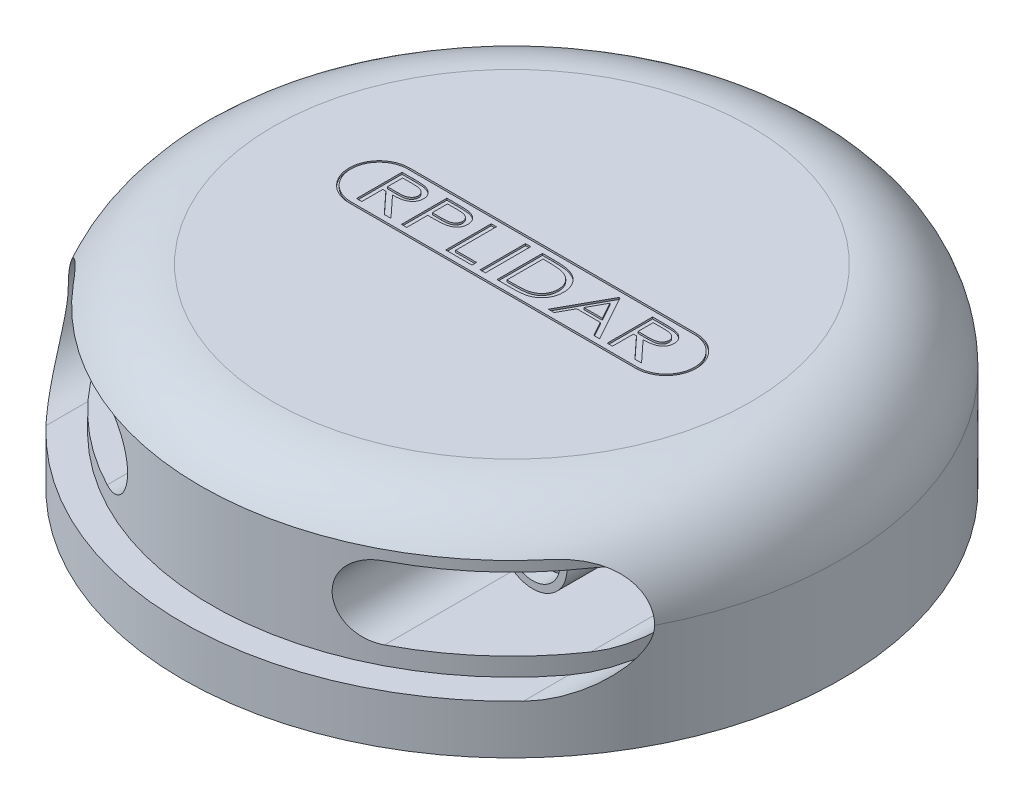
from build123d import *

# Parameters (mm, degrees)
IZIM1_R                     = 36.25
Y_KSEKLIK_EKSTR_ZYON1_DEPTH = 21.4
RADYUS1_R                   = 10
KES_EKSTR_ZYON1_DEPTH       = 41.4
IZIM3_R                     = 33.003248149
Y_KSEKLIK_EKSTR_ZYON2_DEPTH = 12.4
KES_EKSTR_ZYON2_DEPTH       = 44.4
IZIM5_R                     = 3.775
IZIM5_R_2                   = 3
IZIM5_R_3                   = 1.5
Y_KSEKLIK_EKSTR_ZYON4_DEPTH = 16
IZIM6_R                     = 35
KES_EKSTR_ZYON3_DEPTH       = 5
Y_KSEKLIK_EKSTR_ZYON5_START = -3
IZIM8_R                     = 1.5
IZIM8_R_2                   = 3
Y_KSEKLIK_EKSTR_ZYON5_DEPTH = 1
IZIM9_W                     = 0.576923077
IZIM9_H                     = 5
KES_EKSTR_ZYON4_DEPTH       = 0.2
KES_EKSTR_ZYON5_DEPTH       = 0.2


with BuildPart() as part:
    # izim1 → Y_kseklik-Ekstr_zyon1 (new body)
    with BuildSketch(Plane(origin=(0, 0, 0), x_dir=(1, 0, 0), z_dir=(0, 1, 0))):
        with Locations(Location((0, 0, 0), (0, 0, 270))):
            Circle(IZIM1_R)
    extrude(amount=Y_KSEKLIK_EKSTR_ZYON1_DEPTH)

    # Radyus1
    radyus1_edges = [part.edges().sort_by_distance(p)[0] for p in [
        (0, 21.4, -36.25),
    ]]
    fillet(radyus1_edges, radius=RADYUS1_R)

    # izim2 → Kes-Ekstr_zyon1 (cut)
    with BuildSketch(Plane.XY):
        with BuildLine():
            Line((-26.25, 17.4), (26.25, 17.4))
            ThreePointArc((26.25, 17.4), (32.25, 11.4), (26.25, 5.4))
            Line((26.25, 5.4), (-26.25, 5.4))
            ThreePointArc((-26.25, 5.4), (-32.25, 11.4), (-26.25, 17.4))
        make_face()
    extrude(amount=KES_EKSTR_ZYON1_DEPTH, mode=Mode.SUBTRACT)

    # izim3 → Y_kseklik-Ekstr_zyon2 (add)
    with BuildSketch(Plane(origin=(0, 5.4, 0), x_dir=(1, 0, 0), z_dir=(0, 1, 0))):
        Circle(IZIM3_R)
    extrude(amount=Y_KSEKLIK_EKSTR_ZYON2_DEPTH)

    # izim4 → Kes-Ekstr_zyon2 (cut)
    with BuildSketch(Plane.XY):
        with BuildLine():
            Line((-27.25, 15.4), (-15.25, 15.4))
            ThreePointArc((-15.25, 15.4), (-11.25, 11.4), (-15.25, 7.4))
            Line((-15.25, 7.4), (-27.25, 7.4))
            ThreePointArc((-27.25, 7.4), (-31.25, 11.4), (-27.25, 15.4))
        make_face()
        with BuildLine():
            Line((27.25, 15.4), (15.25, 15.4))
            ThreePointArc((15.25, 15.4), (11.25, 11.4), (15.25, 7.4))
            Line((15.25, 7.4), (27.25, 7.4))
            ThreePointArc((27.25, 7.4), (31.25, 11.4), (27.25, 15.4))
        make_face()
    extrude(amount=KES_EKSTR_ZYON2_DEPTH, mode=Mode.SUBTRACT)

    # izim5 → Y_kseklik-Ekstr_zyon4 (add)
    # profile 1 of 2: a face of its own
    with BuildSketch(Plane.XY):
        with Locations(Location((18.281419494, 11.4, 0), (0, 0, 180))):
            Circle(IZIM5_R)
        with Locations((18.281419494, 11.4)):
            Circle(IZIM5_R_2, mode=Mode.SUBTRACT)
    # profile 2 of 2: a face of its own
    with BuildSketch(Plane.XY):
        with Locations((-26.25, 11.4)):
            Circle(IZIM5_R_2)
        with Locations((-26.25, 11.4)):
            Circle(IZIM5_R_3, mode=Mode.SUBTRACT)
    extrude(amount=Y_KSEKLIK_EKSTR_ZYON4_DEPTH)

    # izim6 → Kes-Ekstr_zyon3 (cut)
    with BuildSketch(Plane.XZ):
        with Locations(Location((0, 0, 0), (0, 0, 270))):
            Circle(IZIM6_R)
    extrude(amount=-KES_EKSTR_ZYON3_DEPTH, mode=Mode.SUBTRACT)

    # izim8 → Y_kseklik-Ekstr_zyon5 (add)
    with BuildSketch(Plane.XY.offset(16).offset(Y_KSEKLIK_EKSTR_ZYON5_START)):
        with Locations((-26.25, 11.4)):
            Circle(IZIM8_R)
        with Locations((18.281419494, 11.4)):
            Circle(IZIM8_R_2)
    extrude(amount=Y_KSEKLIK_EKSTR_ZYON5_DEPTH)

    # izim9 → Kes-Ekstr_zyon4 (cut)
    # profile 1 of 7: a face of its own
    with BuildSketch(Plane(origin=(0, 21.4, 0), x_dir=(1, 0, 0), z_dir=(0, 1, 0))):
        with BuildLine():
            Line((-14.811265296, 2.721015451), (-13.627371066, 2.721015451))
            add(Edge.make_bspline(
                [(-13.627371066, 2.721015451), (-13.548244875, 2.720793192), (-13.396329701, 2.720366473), (-13.178606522, 2.717986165), (-12.98065628, 2.71115411), (-12.802931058, 2.705348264), (-12.645070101, 2.694505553), (-12.507339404, 2.684541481), (-12.389357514, 2.670789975), (-12.317901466, 2.658518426), (-12.28522363, 2.652906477)],
                knots=[0, 0, 0, 0, 1.411630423, 2.710203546, 3.884117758, 4.945139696, 5.88215703, 6.706718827, 7.408564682, 8, 8, 8, 8], degree=3))
            add(Edge.make_bspline(
                [(-12.28522363, 2.652906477), (-12.241996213, 2.643872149), (-12.156775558, 2.626061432), (-12.033721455, 2.58862483), (-11.916749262, 2.544151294), (-11.805359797, 2.493741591), (-11.700921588, 2.434021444), (-11.602452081, 2.367805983), (-11.509613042, 2.29454005), (-11.424454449, 2.213570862), (-11.345348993, 2.128176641), (-11.278753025, 2.035341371), (-11.220672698, 1.938996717), (-11.174658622, 1.836946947), (-11.138537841, 1.730578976), (-11.112429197, 1.61925413), (-11.095858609, 1.503233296), (-11.09417105, 1.423996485), (-11.093316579, 1.383876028)],
                knots=[0, 0, 0, 0, 1.11641643, 2.200958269, 3.248516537, 4.279957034, 5.289565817, 6.287204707, 7.27885839, 8.276390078, 9.256727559, 10.217710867, 11.160418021, 12.097511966, 13.042749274, 13.99714418, 14.985881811, 16, 16, 16, 16], degree=3))
            add(Edge.make_bspline(
                [(-11.093316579, 1.383876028), (-11.094253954, 1.350137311), (-11.096104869, 1.283517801), (-11.105764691, 1.184938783), (-11.124030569, 1.089893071), (-11.149031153, 0.997619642), (-11.182319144, 0.909146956), (-11.221524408, 0.822778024), (-11.268558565, 0.740078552), (-11.322707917, 0.660565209), (-11.384212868, 0.585994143), (-11.450083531, 0.513978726), (-11.523642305, 0.448211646), (-11.603000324, 0.386459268), (-11.689506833, 0.331172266), (-11.780867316, 0.27819848), (-11.879220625, 0.231612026), (-11.984085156, 0.189009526), (-12.097345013, 0.15219902), (-12.219458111, 0.118639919), (-12.352204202, 0.09256061), (-12.494755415, 0.069109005), (-12.647858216, 0.051490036), (-12.811222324, 0.038627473), (-12.984595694, 0.030532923), (-13.103523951, 0.029327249), (-13.164630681, 0.028707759)],
                knots=[0, 0, 0, 0, 0.870437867, 1.718741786, 2.551384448, 3.36406043, 4.181467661, 4.986810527, 5.808199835, 6.632248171, 7.464757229, 8.299534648, 9.147007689, 10.006514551, 10.890268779, 11.792828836, 12.72878645, 13.694651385, 14.710400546, 15.798752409, 16.958998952, 18.197760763, 19.524398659, 20.932521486, 22.423893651, 24, 24, 24, 24], degree=3))
            Line((-13.164630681, 0.028707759), (-11.029214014, -2.278984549))
            Line((-11.029214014, -2.278984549), (-11.760383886, -2.278984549))
            Line((-11.760383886, -2.278984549), (-13.895800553, 0.028707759))
            Line((-13.895800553, 0.028707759), (-14.23434222, 0.028707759))
            Line((-14.23434222, 0.028707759), (-14.23434222, -2.278984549))
            Line((-14.23434222, -2.278984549), (-14.811265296, -2.278984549))
            Line((-14.811265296, -2.278984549), (-14.811265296, 2.721015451))
        make_face()
        with BuildLine():
            Line((-14.23434222, 2.208194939), (-14.23434222, 0.541528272))
            Line((-14.23434222, 0.541528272), (-13.18766754, 0.534517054))
            add(Edge.make_bspline(
                [(-13.18766754, 0.534517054), (-13.138582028, 0.534493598), (-13.043720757, 0.534448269), (-12.906502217, 0.540178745), (-12.779219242, 0.546624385), (-12.661954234, 0.55656408), (-12.554368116, 0.569522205), (-12.456697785, 0.585113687), (-12.368746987, 0.604171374), (-12.266340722, 0.632784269), (-12.151725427, 0.677602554), (-12.028064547, 0.745040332), (-11.921230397, 0.827527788), (-11.83125886, 0.923244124), (-11.760411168, 1.029154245), (-11.708128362, 1.142178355), (-11.675668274, 1.261552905), (-11.672056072, 1.343613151), (-11.670239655, 1.384877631)],
                knots=[0, 0, 0, 0, 1.205111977, 2.328965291, 3.371672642, 4.334318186, 5.217938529, 6.031964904, 6.761988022, 7.426368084, 8.641199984, 9.775054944, 10.873689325, 11.940859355, 12.986752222, 13.988165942, 14.988337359, 16, 16, 16, 16], degree=3))
            add(Edge.make_bspline(
                [(-11.670239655, 1.384877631), (-11.672061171, 1.425144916), (-11.675684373, 1.505241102), (-11.708222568, 1.622094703), (-11.761218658, 1.732611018), (-11.834010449, 1.835456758), (-11.922208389, 1.92921002), (-12.025971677, 2.009043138), (-12.142215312, 2.074614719), (-12.250002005, 2.116675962), (-12.346166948, 2.142423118), (-12.429966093, 2.160738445), (-12.524988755, 2.175339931), (-12.631304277, 2.186907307), (-12.748494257, 2.197137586), (-12.877102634, 2.2038767), (-13.016700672, 2.207891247), (-13.113545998, 2.20809142), (-13.163629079, 2.208194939)],
                knots=[0, 0, 0, 0, 1.007089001, 2.003213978, 3.013250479, 4.064283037, 5.146917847, 6.225928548, 7.33072321, 8.480016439, 9.113044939, 9.823344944, 10.627712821, 11.519897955, 12.501985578, 13.574102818, 14.745459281, 16, 16, 16, 16], degree=3))
            Line((-13.163629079, 2.208194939), (-14.23434222, 2.208194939))
        make_face(mode=Mode.SUBTRACT)
    # profile 2 of 7: a face of its own
    with BuildSketch(Plane(origin=(0, 21.4, 0), x_dir=(1, 0, 0), z_dir=(0, 1, 0))):
        with BuildLine():
            Line((-9.875367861, 2.721015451), (-8.710504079, 2.721015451))
            add(Edge.make_bspline(
                [(-8.710504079, 2.721015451), (-8.630373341, 2.720944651), (-8.477111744, 2.720809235), (-8.257084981, 2.71646929), (-8.057404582, 2.710767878), (-7.878103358, 2.702738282), (-7.719387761, 2.693416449), (-7.58118934, 2.680043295), (-7.462638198, 2.666340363), (-7.390996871, 2.652296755), (-7.358340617, 2.645895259)],
                knots=[0, 0, 0, 0, 1.418218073, 2.712546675, 3.894916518, 4.953717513, 5.889237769, 6.708316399, 7.411212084, 8, 8, 8, 8], degree=3))
            add(Edge.make_bspline(
                [(-7.358340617, 2.645895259), (-7.317467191, 2.63642007), (-7.236671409, 2.617690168), (-7.119783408, 2.580660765), (-7.008739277, 2.536245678), (-6.903326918, 2.485000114), (-6.803104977, 2.427412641), (-6.709446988, 2.361436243), (-6.621028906, 2.289515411), (-6.539189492, 2.210256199), (-6.463834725, 2.126181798), (-6.399267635, 2.034792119), (-6.344417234, 1.938827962), (-6.298035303, 1.837655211), (-6.265146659, 1.730271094), (-6.239461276, 1.618239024), (-6.224319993, 1.500809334), (-6.222465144, 1.420644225), (-6.221521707, 1.379869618)],
                knots=[0, 0, 0, 0, 1.086341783, 2.147405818, 3.171829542, 4.181180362, 5.180780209, 6.161883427, 7.145042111, 8.129606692, 9.109794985, 10.064714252, 11.021393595, 11.969594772, 12.940393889, 13.924236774, 14.944198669, 16, 16, 16, 16], degree=3))
            add(Edge.make_bspline(
                [(-6.221521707, 1.379869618), (-6.222555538, 1.33877025), (-6.224578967, 1.258329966), (-6.23834793, 1.140147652), (-6.263672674, 1.027954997), (-6.298011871, 0.921112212), (-6.340494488, 0.819051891), (-6.395686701, 0.723873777), (-6.45849134, 0.632979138), (-6.532189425, 0.549188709), (-6.613551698, 0.470727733), (-6.702713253, 0.398693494), (-6.799247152, 0.333432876), (-6.902784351, 0.275200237), (-7.013805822, 0.224088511), (-7.131866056, 0.179073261), (-7.25777106, 0.14082902), (-7.34485006, 0.1209878), (-7.389390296, 0.110839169)],
                knots=[0, 0, 0, 0, 1.045861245, 2.046974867, 3.021934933, 3.967695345, 4.900313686, 5.828704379, 6.76205769, 7.707550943, 8.662917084, 9.635505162, 10.620482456, 11.624763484, 12.654874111, 13.727818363, 14.837796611, 16, 16, 16, 16], degree=3))
            add(Edge.make_bspline(
                [(-7.389390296, 0.110839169), (-7.426065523, 0.104178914), (-7.506467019, 0.089577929), (-7.638854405, 0.073203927), (-7.792859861, 0.059439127), (-7.968572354, 0.048892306), (-8.165578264, 0.040022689), (-8.384271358, 0.03291367), (-8.624685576, 0.029015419), (-8.792300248, 0.028813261), (-8.879774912, 0.028707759)],
                knots=[0, 0, 0, 0, 0.59852503, 1.312120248, 2.141233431, 3.081389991, 4.138754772, 5.308216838, 6.595213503, 8, 8, 8, 8], degree=3))
            Line((-8.879774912, 0.028707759), (-9.298444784, 0.028707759))
            Line((-9.298444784, 0.028707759), (-9.298444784, -2.278984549))
            Line((-9.298444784, -2.278984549), (-9.875367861, -2.278984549))
            Line((-9.875367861, -2.278984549), (-9.875367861, 2.721015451))
        make_face()
        with BuildLine():
            Line((-9.298444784, 2.208194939), (-9.298444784, 0.541528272))
            Line((-9.298444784, 0.541528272), (-8.294839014, 0.530510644))
            add(Edge.make_bspline(
                [(-8.294839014, 0.530510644), (-8.245753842, 0.530490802), (-8.150893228, 0.530452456), (-8.014003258, 0.536120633), (-7.887068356, 0.542708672), (-7.770432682, 0.552369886), (-7.663986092, 0.565852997), (-7.567729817, 0.579684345), (-7.482103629, 0.599529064), (-7.38228731, 0.626032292), (-7.271042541, 0.671364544), (-7.15018903, 0.737642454), (-7.046293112, 0.821251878), (-6.957257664, 0.916157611), (-6.887843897, 1.022478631), (-6.834970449, 1.134965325), (-6.804201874, 1.254717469), (-6.800372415, 1.336632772), (-6.798444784, 1.377866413)],
                knots=[0, 0, 0, 0, 1.216884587, 2.351716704, 3.39634486, 4.368394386, 5.252429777, 6.056753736, 6.777742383, 7.430440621, 8.615602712, 9.746078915, 10.835909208, 11.907861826, 12.959387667, 13.97058409, 14.978454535, 16, 16, 16, 16], degree=3))
            add(Edge.make_bspline(
                [(-6.798444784, 1.377866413), (-6.800384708, 1.418104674), (-6.804254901, 1.498380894), (-6.835209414, 1.616044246), (-6.887762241, 1.7273631), (-6.957665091, 1.832272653), (-7.044323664, 1.927108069), (-7.145903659, 2.007591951), (-7.259210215, 2.075112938), (-7.365266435, 2.116342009), (-7.459613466, 2.142639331), (-7.541517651, 2.160498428), (-7.633815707, 2.175332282), (-7.736467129, 2.186923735), (-7.849650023, 2.197153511), (-7.973589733, 2.203833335), (-8.10817862, 2.207912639), (-8.201352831, 2.20809841), (-8.249766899, 2.208194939)],
                knots=[0, 0, 0, 0, 1.024572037, 2.044043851, 3.075692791, 4.149430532, 5.245489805, 6.335123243, 7.441242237, 8.594652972, 9.222274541, 9.936592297, 10.729720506, 11.603583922, 12.568814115, 13.625561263, 14.766222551, 16, 16, 16, 16], degree=3))
            Line((-8.249766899, 2.208194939), (-9.298444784, 2.208194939))
        make_face(mode=Mode.SUBTRACT)
    # profile 3 of 7: a face of its own
    with BuildSketch(Plane(origin=(0, 21.4, 0), x_dir=(1, 0, 0), z_dir=(0, 1, 0))):
        Polygon((-5.003572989, 2.721015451), (-4.426649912, 2.721015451), (-4.426649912, -1.766164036), (-2.118957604, -1.766164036), (-2.118957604, -2.278984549), (-5.003572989, -2.278984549), align=None)
    # profile 4 of 7: a face of its own
    with BuildSketch(Plane(origin=(0, 21.4, 0), x_dir=(1, 0, 0), z_dir=(0, 1, 0))):
        with Locations((-0.933060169, 0.221015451)):
            Rectangle(IZIM9_W, IZIM9_H)
    # profile 5 of 7: a face of its own
    with BuildSketch(Plane(origin=(0, 21.4, 0), x_dir=(1, 0, 0), z_dir=(0, 1, 0))):
        with BuildLine():
            Line((0.637452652, -2.278984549), (0.637452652, 2.721015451))
            Line((0.637452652, 2.721015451), (1.836370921, 2.721015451))
            add(Edge.make_bspline(
                [(1.836370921, 2.721015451), (1.940876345, 2.720385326), (2.142574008, 2.71916917), (2.433791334, 2.711417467), (2.702677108, 2.697772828), (2.949134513, 2.677650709), (3.173764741, 2.653365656), (3.376299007, 2.622480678), (3.55677558, 2.586624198), (3.668125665, 2.555387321), (3.720385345, 2.54072699)],
                knots=[0, 0, 0, 0, 1.3211948, 2.549933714, 3.682670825, 4.72443222, 5.675778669, 6.538377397, 7.314020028, 8, 8, 8, 8], degree=3))
            add(Edge.make_bspline(
                [(3.720385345, 2.54072699), (3.78885106, 2.518690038), (3.923860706, 2.475234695), (4.117410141, 2.393701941), (4.299204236, 2.300062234), (4.470798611, 2.196092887), (4.629410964, 2.078397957), (4.778390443, 1.951125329), (4.913262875, 1.809885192), (5.037791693, 1.658991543), (5.148542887, 1.498054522), (5.245546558, 1.329083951), (5.326280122, 1.152059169), (5.394413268, 0.968294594), (5.444930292, 0.775878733), (5.481642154, 0.576344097), (5.505906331, 0.369514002), (5.508123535, 0.229097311), (5.509247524, 0.15791449)],
                knots=[0, 0, 0, 0, 1.07436122, 2.118565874, 3.133765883, 4.127984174, 5.11282082, 6.081965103, 7.052225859, 8.026990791, 9.002585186, 9.967895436, 10.934455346, 11.906676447, 12.892927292, 13.902719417, 14.936804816, 16, 16, 16, 16], degree=3))
            add(Edge.make_bspline(
                [(5.509247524, 0.15791449), (5.50800468, 0.096116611), (5.505554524, -0.025712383), (5.488794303, -0.205603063), (5.458167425, -0.379469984), (5.417247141, -0.547832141), (5.365414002, -0.711283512), (5.299748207, -0.868246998), (5.223846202, -1.020327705), (5.135243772, -1.164883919), (5.03887547, -1.302648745), (4.933836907, -1.431592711), (4.822507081, -1.551539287), (4.702978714, -1.66121317), (4.578158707, -1.762801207), (4.445079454, -1.854367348), (4.304818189, -1.936036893), (4.157101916, -2.010455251), (3.998149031, -2.07508686), (3.825271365, -2.129897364), (3.637389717, -2.17546385), (3.434426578, -2.213334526), (3.21650904, -2.243263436), (2.983182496, -2.263630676), (2.735302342, -2.277131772), (2.564888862, -2.27835601), (2.477396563, -2.278984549)],
                knots=[0, 0, 0, 0, 1.007638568, 1.986469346, 2.942307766, 3.883713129, 4.809932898, 5.734968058, 6.655233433, 7.578585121, 8.496851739, 9.394671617, 10.288256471, 11.162750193, 12.037599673, 12.910397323, 13.793641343, 14.68225427, 15.605220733, 16.588265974, 17.636610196, 18.755552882, 19.95349296, 21.221625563, 22.573549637, 24, 24, 24, 24], degree=3))
            Line((2.477396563, -2.278984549), (0.637452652, -2.278984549))
        make_face()
        with BuildLine():
            Line((1.214375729, -1.766164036), (1.880441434, -1.766164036))
            add(Edge.make_bspline(
                [(1.880441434, -1.766164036), (1.976264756, -1.76581211), (2.160252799, -1.765136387), (2.424719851, -1.759143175), (2.666163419, -1.74937351), (2.88493929, -1.735682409), (3.080638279, -1.717678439), (3.253852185, -1.697337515), (3.40418184, -1.672322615), (3.495804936, -1.649496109), (3.538093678, -1.63896051)],
                knots=[0, 0, 0, 0, 1.380201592, 2.650091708, 3.810045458, 4.860555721, 5.807075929, 6.640357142, 7.372455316, 8, 8, 8, 8], degree=3))
            add(Edge.make_bspline(
                [(3.538093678, -1.63896051), (3.591068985, -1.622949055), (3.695155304, -1.591489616), (3.845436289, -1.533211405), (3.986347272, -1.464839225), (4.119648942, -1.388963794), (4.24309805, -1.302459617), (4.35738543, -1.206669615), (4.464582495, -1.103492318), (4.561401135, -0.990171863), (4.648381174, -0.869138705), (4.724912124, -0.741725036), (4.789533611, -0.607702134), (4.841418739, -0.466661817), (4.88267694, -0.319349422), (4.911527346, -0.165528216), (4.928781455, -0.005408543), (4.931128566, 0.103450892), (4.932324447, 0.158916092)],
                knots=[0, 0, 0, 0, 1.078749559, 2.11953602, 3.138517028, 4.12999422, 5.106941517, 6.072897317, 7.034985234, 8.004378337, 8.974470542, 9.9378788, 10.898644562, 11.870787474, 12.864185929, 13.877851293, 14.918739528, 16, 16, 16, 16], degree=3))
            add(Edge.make_bspline(
                [(4.932324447, 0.158916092), (4.93128137, 0.217395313), (4.929231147, 0.332339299), (4.909767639, 0.501207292), (4.877615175, 0.663261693), (4.833326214, 0.818975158), (4.777845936, 0.969098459), (4.706678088, 1.111588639), (4.624641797, 1.248160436), (4.530358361, 1.377760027), (4.42424139, 1.498215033), (4.308720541, 1.610672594), (4.181675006, 1.711203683), (4.046589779, 1.804372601), (3.900062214, 1.885051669), (3.744855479, 1.95772211), (3.578720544, 2.018752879), (3.463539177, 2.051363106), (3.404880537, 2.06797058)],
                knots=[0, 0, 0, 0, 1.058669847, 2.080871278, 3.073316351, 4.047471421, 5.009847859, 5.967025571, 6.92717743, 7.89220902, 8.864786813, 9.831124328, 10.807453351, 11.795172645, 12.799353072, 13.832651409, 14.896230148, 16, 16, 16, 16], degree=3))
            add(Edge.make_bspline(
                [(3.404880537, 2.06797058), (3.356258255, 2.079589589), (3.252310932, 2.104429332), (3.083799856, 2.13090293), (2.893764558, 2.155039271), (2.681981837, 2.174829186), (2.447814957, 2.189382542), (2.192018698, 2.200109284), (1.914204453, 2.207445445), (1.721859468, 2.20793885), (1.622027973, 2.208194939)],
                knots=[0, 0, 0, 0, 0.669246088, 1.430750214, 2.28257198, 3.234651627, 4.278572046, 5.424227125, 6.663114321, 8, 8, 8, 8], degree=3))
            Line((1.622027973, 2.208194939), (1.214375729, 2.208194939))
            Line((1.214375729, 2.208194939), (1.214375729, -1.766164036))
        make_face(mode=Mode.SUBTRACT)
    # profile 6 of 7: a face of its own
    with BuildSketch(Plane(origin=(0, 21.4, 0), x_dir=(1, 0, 0), z_dir=(0, 1, 0))):
        Polygon((9.163093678, 2.721015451), (11.919503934, -2.278984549), (11.283486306, -2.278984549), (10.400072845, -0.676420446), (7.798910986, -0.676420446), (6.914495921, -2.278984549), (6.278478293, -2.278984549), (9.03488855, 2.721015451), align=None)
        Polygon((9.098991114, 1.682353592), (8.080361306, -0.163599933), (10.116619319, -0.163599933), align=None, mode=Mode.SUBTRACT)
    # profile 7 of 7: a face of its own
    with BuildSketch(Plane(origin=(0, 21.4, 0), x_dir=(1, 0, 0), z_dir=(0, 1, 0))):
        with BuildLine():
            Line((12.752837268, 2.721015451), (13.936731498, 2.721015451))
            add(Edge.make_bspline(
                [(13.936731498, 2.721015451), (14.015857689, 2.720793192), (14.167772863, 2.720366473), (14.385496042, 2.717986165), (14.583446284, 2.71115411), (14.761171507, 2.705348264), (14.919032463, 2.694505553), (15.05676316, 2.684541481), (15.17474505, 2.670789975), (15.246201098, 2.658518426), (15.278878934, 2.652906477)],
                knots=[0, 0, 0, 0, 1.411630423, 2.710203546, 3.884117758, 4.945139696, 5.88215703, 6.706718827, 7.408564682, 8, 8, 8, 8], degree=3))
            add(Edge.make_bspline(
                [(15.278878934, 2.652906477), (15.322106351, 2.643872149), (15.407327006, 2.626061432), (15.530381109, 2.58862483), (15.647353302, 2.544151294), (15.758742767, 2.493741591), (15.863180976, 2.434021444), (15.961650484, 2.367805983), (16.054489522, 2.29454005), (16.139648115, 2.213570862), (16.218753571, 2.128176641), (16.285349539, 2.035341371), (16.343429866, 1.938996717), (16.389443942, 1.836946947), (16.425564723, 1.730578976), (16.451673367, 1.61925413), (16.468243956, 1.503233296), (16.469931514, 1.423996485), (16.470785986, 1.383876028)],
                knots=[0, 0, 0, 0, 1.11641643, 2.200958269, 3.248516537, 4.279957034, 5.289565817, 6.287204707, 7.27885839, 8.276390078, 9.256727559, 10.217710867, 11.160418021, 12.097511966, 13.042749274, 13.99714418, 14.985881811, 16, 16, 16, 16], degree=3))
            add(Edge.make_bspline(
                [(16.470785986, 1.383876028), (16.46984861, 1.350137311), (16.467997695, 1.283517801), (16.458337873, 1.184938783), (16.440071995, 1.089893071), (16.415071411, 0.997619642), (16.38178342, 0.909146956), (16.342578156, 0.822778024), (16.295543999, 0.740078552), (16.241394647, 0.660565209), (16.179889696, 0.585994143), (16.114019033, 0.513978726), (16.040460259, 0.448211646), (15.96110224, 0.386459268), (15.874595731, 0.331172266), (15.783235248, 0.27819848), (15.684881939, 0.231612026), (15.580017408, 0.189009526), (15.466757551, 0.15219902), (15.344644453, 0.118639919), (15.211898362, 0.09256061), (15.069347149, 0.069109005), (14.916244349, 0.051490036), (14.75288024, 0.038627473), (14.57950687, 0.030532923), (14.460578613, 0.029327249), (14.399471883, 0.028707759)],
                knots=[0, 0, 0, 0, 0.870437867, 1.718741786, 2.551384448, 3.36406043, 4.181467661, 4.986810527, 5.808199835, 6.632248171, 7.464757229, 8.299534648, 9.147007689, 10.006514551, 10.890268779, 11.792828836, 12.72878645, 13.694651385, 14.710400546, 15.798752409, 16.958998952, 18.197760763, 19.524398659, 20.932521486, 22.423893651, 24, 24, 24, 24], degree=3))
            Line((14.399471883, 0.028707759), (16.53488855, -2.278984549))
            Line((16.53488855, -2.278984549), (15.803718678, -2.278984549))
            Line((15.803718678, -2.278984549), (13.668302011, 0.028707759))
            Line((13.668302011, 0.028707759), (13.329760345, 0.028707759))
            Line((13.329760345, 0.028707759), (13.329760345, -2.278984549))
            Line((13.329760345, -2.278984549), (12.752837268, -2.278984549))
            Line((12.752837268, -2.278984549), (12.752837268, 2.721015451))
        make_face()
        with BuildLine():
            Line((13.329760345, 2.208194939), (13.329760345, 0.541528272))
            Line((13.329760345, 0.541528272), (14.376435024, 0.534517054))
            add(Edge.make_bspline(
                [(14.376435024, 0.534517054), (14.425520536, 0.534493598), (14.520381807, 0.534448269), (14.657600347, 0.540178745), (14.784883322, 0.546624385), (14.90214833, 0.55656408), (15.009734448, 0.569522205), (15.107404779, 0.585113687), (15.195355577, 0.604171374), (15.297761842, 0.632784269), (15.412377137, 0.677602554), (15.536038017, 0.745040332), (15.642872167, 0.827527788), (15.732843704, 0.923244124), (15.803691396, 1.029154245), (15.855974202, 1.142178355), (15.888434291, 1.261552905), (15.892046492, 1.343613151), (15.893862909, 1.384877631)],
                knots=[0, 0, 0, 0, 1.205111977, 2.328965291, 3.371672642, 4.334318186, 5.217938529, 6.031964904, 6.761988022, 7.426368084, 8.641199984, 9.775054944, 10.873689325, 11.940859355, 12.986752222, 13.988165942, 14.988337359, 16, 16, 16, 16], degree=3))
            add(Edge.make_bspline(
                [(15.893862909, 1.384877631), (15.892041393, 1.425144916), (15.888418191, 1.505241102), (15.855879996, 1.622094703), (15.802883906, 1.732611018), (15.730092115, 1.835456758), (15.641894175, 1.92921002), (15.538130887, 2.009043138), (15.421887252, 2.074614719), (15.314100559, 2.116675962), (15.217935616, 2.142423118), (15.134136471, 2.160738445), (15.03911381, 2.175339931), (14.932798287, 2.186907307), (14.815608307, 2.197137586), (14.68699993, 2.2038767), (14.547401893, 2.207891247), (14.450556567, 2.20809142), (14.400473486, 2.208194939)],
                knots=[0, 0, 0, 0, 1.007089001, 2.003213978, 3.013250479, 4.064283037, 5.146917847, 6.225928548, 7.33072321, 8.480016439, 9.113044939, 9.823344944, 10.627712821, 11.519897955, 12.501985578, 13.574102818, 14.745459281, 16, 16, 16, 16], degree=3))
            Line((14.400473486, 2.208194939), (13.329760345, 2.208194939))
        make_face(mode=Mode.SUBTRACT)
    extrude(amount=-KES_EKSTR_ZYON4_DEPTH, mode=Mode.SUBTRACT)

    # izim10 → Kes-Ekstr_zyon5 (cut)
    with BuildSketch(Plane(origin=(0, 21.4, 0), x_dir=(1, 0, 0), z_dir=(0, 1, 0))):
        with BuildLine():
            Line((-14.811265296, 3.545310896), (16.728928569, 3.545310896))
            ThreePointArc((16.728928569, 3.545310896), (20.053224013, 0.221015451), (16.728928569, -3.103279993))
            Line((16.728928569, -3.103279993), (-14.811265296, -3.103279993))
            ThreePointArc((-14.811265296, -3.103279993), (-18.135560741, 0.221015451), (-14.811265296, 3.545310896))
        make_face()
        with BuildLine():
            Line((-14.811265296, 3.345310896), (16.728928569, 3.345310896))
            ThreePointArc((16.728928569, 3.345310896), (19.853224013, 0.221015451), (16.728928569, -2.903279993))
            Line((16.728928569, -2.903279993), (-14.811265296, -2.903279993))
            ThreePointArc((-14.811265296, -2.903279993), (-17.935560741, 0.221015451), (-14.811265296, 3.345310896))
        make_face(mode=Mode.SUBTRACT)
    extrude(amount=-KES_EKSTR_ZYON5_DEPTH, mode=Mode.SUBTRACT)


solid = part.part
